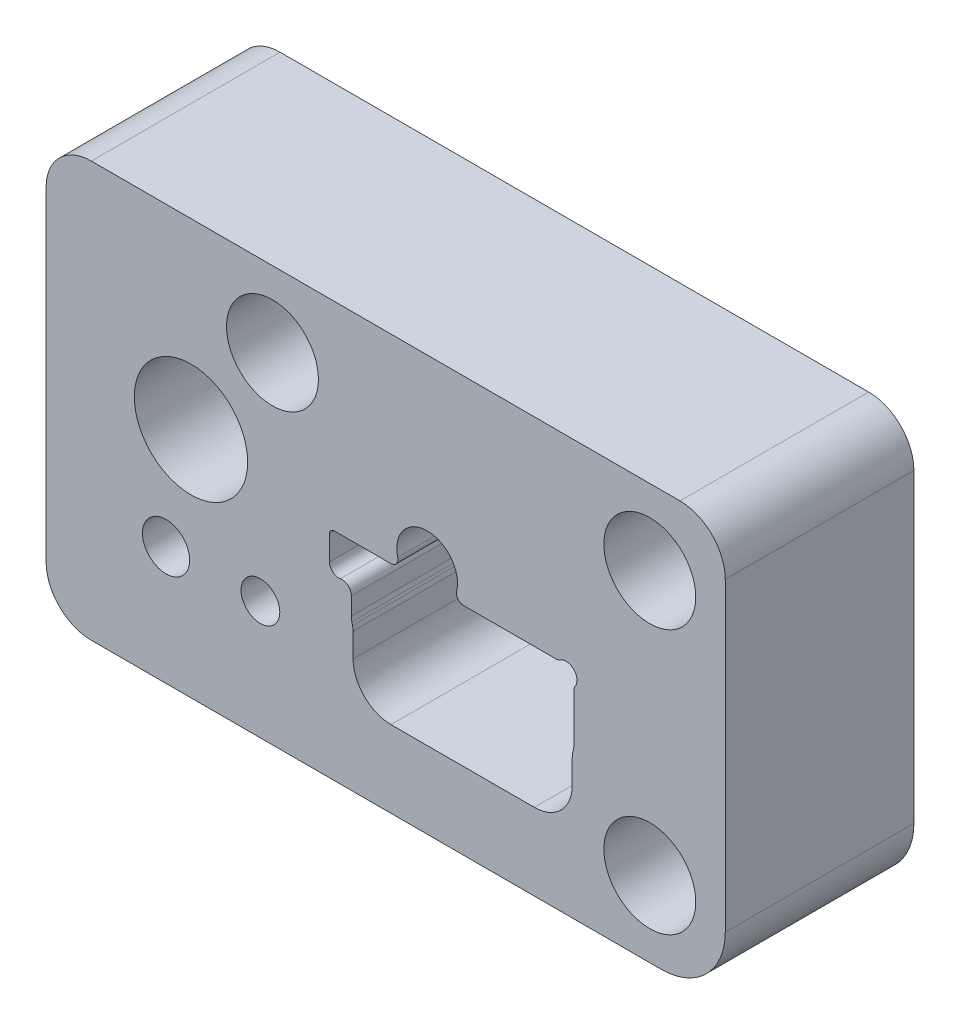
ISO-10303-21;
HEADER;
FILE_DESCRIPTION(('STEP AP214'),'2;1');
FILE_NAME('part.step','',(''),(''),'','','');
FILE_SCHEMA(('AUTOMOTIVE_DESIGN { 1 0 10303 214 1 1 1 1 }'));
ENDSEC;
DATA;
#1=APPLICATION_CONTEXT('core data for automotive mechanical design processes');
#2=APPLICATION_PROTOCOL_DEFINITION('international standard','automotive_design',2000,#1);
#3=PRODUCT_CONTEXT('',#1,'mechanical');
#4=PRODUCT('Part','Part','',(#3));
#5=PRODUCT_RELATED_PRODUCT_CATEGORY('part','',(#4));
#6=PRODUCT_DEFINITION_FORMATION('','',#4);
#7=PRODUCT_DEFINITION_CONTEXT('part definition',#1,'design');
#8=PRODUCT_DEFINITION('design','',#6,#7);
#9=PRODUCT_DEFINITION_SHAPE('','',#8);
#10=(LENGTH_UNIT() NAMED_UNIT(*) SI_UNIT(.MILLI.,.METRE.));
#11=(NAMED_UNIT(*) PLANE_ANGLE_UNIT() SI_UNIT($,.RADIAN.));
#12=(NAMED_UNIT(*) SI_UNIT($,.STERADIAN.) SOLID_ANGLE_UNIT());
#13=UNCERTAINTY_MEASURE_WITH_UNIT(LENGTH_MEASURE(1.E-05),#10,'distance_accuracy_value','');
#14=(GEOMETRIC_REPRESENTATION_CONTEXT(3) GLOBAL_UNCERTAINTY_ASSIGNED_CONTEXT((#13)) GLOBAL_UNIT_ASSIGNED_CONTEXT((#10,
#11,#12)) REPRESENTATION_CONTEXT('',''));
#15=CARTESIAN_POINT('',(0.,0.,0.));
#16=DIRECTION('',(0.,0.,1.));
#17=DIRECTION('',(1.,0.,0.));
#18=AXIS2_PLACEMENT_3D('',#15,#16,#17);
#19=CARTESIAN_POINT('',(-156.27604,-88.8003363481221,-31.75));
#20=DIRECTION('',(-1.,0.,0.));
#21=DIRECTION('',(0.,-1.,0.));
#22=AXIS2_PLACEMENT_3D('',#19,#20,#21);
#23=PLANE('',#22);
#24=DIRECTION('',(0.,0.,1.));
#25=VECTOR('',#24,1.);
#26=CARTESIAN_POINT('',(-156.27604,-89.1130965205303,-31.75));
#27=LINE('',#26,#25);
#28=CARTESIAN_POINT('',(-156.27604,-89.1130965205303,-31.75));
#29=VERTEX_POINT('',#28);
#30=CARTESIAN_POINT('',(-156.27604,-89.1130965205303,0.));
#31=VERTEX_POINT('',#30);
#32=EDGE_CURVE('E607',#29,#31,#27,.T.);
#33=ORIENTED_EDGE('',*,*,#32,.T.);
#34=DIRECTION('',(0.,-1.,0.));
#35=VECTOR('',#34,1.);
#36=CARTESIAN_POINT('',(-156.27604,-88.8003363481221,0.));
#37=LINE('',#36,#35);
#38=CARTESIAN_POINT('',(-156.27604,-92.0343710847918,0.));
#39=VERTEX_POINT('',#38);
#40=EDGE_CURVE('E561',#31,#39,#37,.T.);
#41=ORIENTED_EDGE('',*,*,#40,.T.);
#42=DIRECTION('',(0.,0.,1.));
#43=VECTOR('',#42,1.);
#44=CARTESIAN_POINT('',(-156.27604,-92.0343710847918,-31.75));
#45=LINE('',#44,#43);
#46=CARTESIAN_POINT('',(-156.27604,-92.0343710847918,-31.75));
#47=VERTEX_POINT('',#46);
#48=EDGE_CURVE('E291',#47,#39,#45,.T.);
#49=ORIENTED_EDGE('',*,*,#48,.F.);
#50=DIRECTION('',(0.,-1.,0.));
#51=VECTOR('',#50,1.);
#52=CARTESIAN_POINT('',(-156.27604,-88.8003363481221,-31.75));
#53=LINE('',#52,#51);
#54=EDGE_CURVE('E72',#29,#47,#53,.T.);
#55=ORIENTED_EDGE('',*,*,#54,.F.);
#56=EDGE_LOOP('',(#33,#41,#49,#55));
#57=FACE_BOUND('',#56,.T.);
#58=ADVANCED_FACE('F47',(#57),#23,.F.);
#59=CARTESIAN_POINT('',(-100.965,-55.245,-31.75));
#60=DIRECTION('',(0.,0.,1.));
#61=DIRECTION('',(1.,0.,0.));
#62=AXIS2_PLACEMENT_3D('',#59,#60,#61);
#63=CYLINDRICAL_SURFACE('',#62,7.62000000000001);
#64=CARTESIAN_POINT('',(-100.965,-55.245,0.));
#65=DIRECTION('',(0.,0.,1.));
#66=DIRECTION('',(-1.,0.,0.));
#67=AXIS2_PLACEMENT_3D('',#64,#65,#66);
#68=CIRCLE('',#67,7.62000000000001);
#69=CARTESIAN_POINT('',(-93.345,-55.245,0.));
#70=VERTEX_POINT('',#69);
#71=CARTESIAN_POINT('',(-100.965,-47.625,0.));
#72=VERTEX_POINT('',#71);
#73=EDGE_CURVE('E393',#70,#72,#68,.T.);
#74=ORIENTED_EDGE('',*,*,#73,.F.);
#75=DIRECTION('',(0.,0.,1.));
#76=VECTOR('',#75,1.);
#77=CARTESIAN_POINT('',(-93.345,-55.245,-31.75));
#78=LINE('',#77,#76);
#79=CARTESIAN_POINT('',(-93.345,-55.245,-31.75));
#80=VERTEX_POINT('',#79);
#81=EDGE_CURVE('E11',#80,#70,#78,.T.);
#82=ORIENTED_EDGE('',*,*,#81,.F.);
#83=CARTESIAN_POINT('',(-100.965,-55.245,-31.75));
#84=DIRECTION('',(0.,0.,1.));
#85=DIRECTION('',(-1.,0.,0.));
#86=AXIS2_PLACEMENT_3D('',#83,#84,#85);
#87=CIRCLE('',#86,7.62000000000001);
#88=CARTESIAN_POINT('',(-100.965,-47.625,-31.75));
#89=VERTEX_POINT('',#88);
#90=EDGE_CURVE('E394',#80,#89,#87,.T.);
#91=ORIENTED_EDGE('',*,*,#90,.T.);
#92=DIRECTION('',(0.,0.,1.));
#93=VECTOR('',#92,1.);
#94=CARTESIAN_POINT('',(-100.965,-47.625,-31.75));
#95=LINE('',#94,#93);
#96=EDGE_CURVE('E51',#89,#72,#95,.T.);
#97=ORIENTED_EDGE('',*,*,#96,.T.);
#98=EDGE_LOOP('',(#74,#82,#91,#97));
#99=FACE_BOUND('',#98,.T.);
#100=ADVANCED_FACE('F49',(#99),#63,.T.);
#101=CARTESIAN_POINT('',(-93.345,-55.245,-31.75));
#102=DIRECTION('',(1.,0.,0.));
#103=DIRECTION('',(0.,0.,-1.));
#104=AXIS2_PLACEMENT_3D('',#101,#102,#103);
#105=PLANE('',#104);
#106=DIRECTION('',(0.,1.,0.));
#107=VECTOR('',#106,1.);
#108=CARTESIAN_POINT('',(-93.345,-55.245,0.));
#109=LINE('',#108,#107);
#110=CARTESIAN_POINT('',(-93.345,-106.68,0.));
#111=VERTEX_POINT('',#110);
#112=EDGE_CURVE('E398',#111,#70,#109,.T.);
#113=ORIENTED_EDGE('',*,*,#112,.F.);
#114=DIRECTION('',(0.,0.,1.));
#115=VECTOR('',#114,1.);
#116=CARTESIAN_POINT('',(-93.345,-106.68,-31.75));
#117=LINE('',#116,#115);
#118=CARTESIAN_POINT('',(-93.345,-106.68,-31.75));
#119=VERTEX_POINT('',#118);
#120=EDGE_CURVE('E56',#119,#111,#117,.T.);
#121=ORIENTED_EDGE('',*,*,#120,.F.);
#122=DIRECTION('',(0.,1.,0.));
#123=VECTOR('',#122,1.);
#124=CARTESIAN_POINT('',(-93.345,-55.245,-31.75));
#125=LINE('',#124,#123);
#126=EDGE_CURVE('E416',#119,#80,#125,.T.);
#127=ORIENTED_EDGE('',*,*,#126,.T.);
#128=ORIENTED_EDGE('',*,*,#81,.T.);
#129=EDGE_LOOP('',(#113,#121,#127,#128));
#130=FACE_BOUND('',#129,.T.);
#131=ADVANCED_FACE('F463',(#130),#105,.T.);
#132=CARTESIAN_POINT('',(-104.14,-106.68,-31.75));
#133=DIRECTION('',(0.,0.,1.));
#134=DIRECTION('',(1.,0.,0.));
#135=AXIS2_PLACEMENT_3D('',#132,#133,#134);
#136=CYLINDRICAL_SURFACE('',#135,10.795);
#137=CARTESIAN_POINT('',(-104.14,-106.68,0.));
#138=DIRECTION('',(0.,0.,1.));
#139=DIRECTION('',(1.,0.,0.));
#140=AXIS2_PLACEMENT_3D('',#137,#138,#139);
#141=CIRCLE('',#140,10.795);
#142=CARTESIAN_POINT('',(-104.14,-117.475,0.));
#143=VERTEX_POINT('',#142);
#144=EDGE_CURVE('E436',#143,#111,#141,.T.);
#145=ORIENTED_EDGE('',*,*,#144,.F.);
#146=DIRECTION('',(0.,0.,1.));
#147=VECTOR('',#146,1.);
#148=CARTESIAN_POINT('',(-104.14,-117.475,-31.75));
#149=LINE('',#148,#147);
#150=CARTESIAN_POINT('',(-104.14,-117.475,-31.75));
#151=VERTEX_POINT('',#150);
#152=EDGE_CURVE('E442',#151,#143,#149,.T.);
#153=ORIENTED_EDGE('',*,*,#152,.F.);
#154=CARTESIAN_POINT('',(-104.14,-106.68,-31.75));
#155=DIRECTION('',(0.,0.,1.));
#156=DIRECTION('',(1.,0.,0.));
#157=AXIS2_PLACEMENT_3D('',#154,#155,#156);
#158=CIRCLE('',#157,10.795);
#159=EDGE_CURVE('E413',#151,#119,#158,.T.);
#160=ORIENTED_EDGE('',*,*,#159,.T.);
#161=ORIENTED_EDGE('',*,*,#120,.T.);
#162=EDGE_LOOP('',(#145,#153,#160,#161));
#163=FACE_BOUND('',#162,.T.);
#164=ADVANCED_FACE('F483',(#163),#136,.T.);
#165=CARTESIAN_POINT('',(-200.025,-117.475,-31.75));
#166=DIRECTION('',(0.,-1.,0.));
#167=DIRECTION('',(1.,0.,0.));
#168=AXIS2_PLACEMENT_3D('',#165,#166,#167);
#169=PLANE('',#168);
#170=DIRECTION('',(1.,0.,0.));
#171=VECTOR('',#170,1.);
#172=CARTESIAN_POINT('',(-200.025,-117.475,0.));
#173=LINE('',#172,#171);
#174=CARTESIAN_POINT('',(-200.025,-117.475,0.));
#175=VERTEX_POINT('',#174);
#176=EDGE_CURVE('E433',#175,#143,#173,.T.);
#177=ORIENTED_EDGE('',*,*,#176,.F.);
#178=DIRECTION('',(0.,0.,1.));
#179=VECTOR('',#178,1.);
#180=CARTESIAN_POINT('',(-200.025,-117.475,-31.75));
#181=LINE('',#180,#179);
#182=CARTESIAN_POINT('',(-200.025,-117.475,-31.75));
#183=VERTEX_POINT('',#182);
#184=EDGE_CURVE('E444',#183,#175,#181,.T.);
#185=ORIENTED_EDGE('',*,*,#184,.F.);
#186=DIRECTION('',(1.,0.,0.));
#187=VECTOR('',#186,1.);
#188=CARTESIAN_POINT('',(-200.025,-117.475,-31.75));
#189=LINE('',#188,#187);
#190=EDGE_CURVE('E410',#183,#151,#189,.T.);
#191=ORIENTED_EDGE('',*,*,#190,.T.);
#192=ORIENTED_EDGE('',*,*,#152,.T.);
#193=EDGE_LOOP('',(#177,#185,#191,#192));
#194=FACE_BOUND('',#193,.T.);
#195=ADVANCED_FACE('F481',(#194),#169,.T.);
#196=CARTESIAN_POINT('',(-200.025,-109.855,-31.75));
#197=DIRECTION('',(0.,0.,1.));
#198=DIRECTION('',(1.,0.,0.));
#199=AXIS2_PLACEMENT_3D('',#196,#197,#198);
#200=CYLINDRICAL_SURFACE('',#199,7.61999999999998);
#201=CARTESIAN_POINT('',(-200.025,-109.855,0.));
#202=DIRECTION('',(0.,0.,1.));
#203=DIRECTION('',(1.,0.,0.));
#204=AXIS2_PLACEMENT_3D('',#201,#202,#203);
#205=CIRCLE('',#204,7.61999999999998);
#206=CARTESIAN_POINT('',(-207.645,-109.855,0.));
#207=VERTEX_POINT('',#206);
#208=EDGE_CURVE('E430',#207,#175,#205,.T.);
#209=ORIENTED_EDGE('',*,*,#208,.F.);
#210=DIRECTION('',(0.,0.,1.));
#211=VECTOR('',#210,1.);
#212=CARTESIAN_POINT('',(-207.645,-109.855,-31.75));
#213=LINE('',#212,#211);
#214=CARTESIAN_POINT('',(-207.645,-109.855,-31.75));
#215=VERTEX_POINT('',#214);
#216=EDGE_CURVE('E446',#215,#207,#213,.T.);
#217=ORIENTED_EDGE('',*,*,#216,.F.);
#218=CARTESIAN_POINT('',(-200.025,-109.855,-31.75));
#219=DIRECTION('',(0.,0.,1.));
#220=DIRECTION('',(1.,0.,0.));
#221=AXIS2_PLACEMENT_3D('',#218,#219,#220);
#222=CIRCLE('',#221,7.61999999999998);
#223=EDGE_CURVE('E407',#215,#183,#222,.T.);
#224=ORIENTED_EDGE('',*,*,#223,.T.);
#225=ORIENTED_EDGE('',*,*,#184,.T.);
#226=EDGE_LOOP('',(#209,#217,#224,#225));
#227=FACE_BOUND('',#226,.T.);
#228=ADVANCED_FACE('F477',(#227),#200,.T.);
#229=CARTESIAN_POINT('',(-207.645,-55.245,-31.75));
#230=DIRECTION('',(-1.,0.,0.));
#231=DIRECTION('',(0.,-1.,0.));
#232=AXIS2_PLACEMENT_3D('',#229,#230,#231);
#233=PLANE('',#232);
#234=DIRECTION('',(0.,-1.,0.));
#235=VECTOR('',#234,1.);
#236=CARTESIAN_POINT('',(-207.645,-55.245,0.));
#237=LINE('',#236,#235);
#238=CARTESIAN_POINT('',(-207.645,-55.245,0.));
#239=VERTEX_POINT('',#238);
#240=EDGE_CURVE('E427',#239,#207,#237,.T.);
#241=ORIENTED_EDGE('',*,*,#240,.F.);
#242=DIRECTION('',(0.,0.,1.));
#243=VECTOR('',#242,1.);
#244=CARTESIAN_POINT('',(-207.645,-55.245,-31.75));
#245=LINE('',#244,#243);
#246=CARTESIAN_POINT('',(-207.645,-55.245,-31.75));
#247=VERTEX_POINT('',#246);
#248=EDGE_CURVE('E448',#247,#239,#245,.T.);
#249=ORIENTED_EDGE('',*,*,#248,.F.);
#250=DIRECTION('',(0.,-1.,0.));
#251=VECTOR('',#250,1.);
#252=CARTESIAN_POINT('',(-207.645,-55.245,-31.75));
#253=LINE('',#252,#251);
#254=EDGE_CURVE('E404',#247,#215,#253,.T.);
#255=ORIENTED_EDGE('',*,*,#254,.T.);
#256=ORIENTED_EDGE('',*,*,#216,.T.);
#257=EDGE_LOOP('',(#241,#249,#255,#256));
#258=FACE_BOUND('',#257,.T.);
#259=ADVANCED_FACE('F475',(#258),#233,.T.);
#260=CARTESIAN_POINT('',(-200.025,-55.245,-31.75));
#261=DIRECTION('',(0.,0.,1.));
#262=DIRECTION('',(1.,0.,0.));
#263=AXIS2_PLACEMENT_3D('',#260,#261,#262);
#264=CYLINDRICAL_SURFACE('',#263,7.62);
#265=CARTESIAN_POINT('',(-200.025,-55.245,0.));
#266=DIRECTION('',(0.,0.,1.));
#267=DIRECTION('',(1.,0.,0.));
#268=AXIS2_PLACEMENT_3D('',#265,#266,#267);
#269=CIRCLE('',#268,7.62);
#270=CARTESIAN_POINT('',(-200.025,-47.625,0.));
#271=VERTEX_POINT('',#270);
#272=EDGE_CURVE('E424',#271,#239,#269,.T.);
#273=ORIENTED_EDGE('',*,*,#272,.F.);
#274=DIRECTION('',(0.,0.,1.));
#275=VECTOR('',#274,1.);
#276=CARTESIAN_POINT('',(-200.025,-47.625,-31.75));
#277=LINE('',#276,#275);
#278=CARTESIAN_POINT('',(-200.025,-47.625,-31.75));
#279=VERTEX_POINT('',#278);
#280=EDGE_CURVE('E449',#279,#271,#277,.T.);
#281=ORIENTED_EDGE('',*,*,#280,.F.);
#282=CARTESIAN_POINT('',(-200.025,-55.245,-31.75));
#283=DIRECTION('',(0.,0.,1.));
#284=DIRECTION('',(1.,0.,0.));
#285=AXIS2_PLACEMENT_3D('',#282,#283,#284);
#286=CIRCLE('',#285,7.62);
#287=EDGE_CURVE('E401',#279,#247,#286,.T.);
#288=ORIENTED_EDGE('',*,*,#287,.T.);
#289=ORIENTED_EDGE('',*,*,#248,.T.);
#290=EDGE_LOOP('',(#273,#281,#288,#289));
#291=FACE_BOUND('',#290,.T.);
#292=ADVANCED_FACE('F471',(#291),#264,.T.);
#293=CARTESIAN_POINT('',(-200.025,-47.625,-31.75));
#294=DIRECTION('',(0.,1.,0.));
#295=DIRECTION('',(0.,0.,1.));
#296=AXIS2_PLACEMENT_3D('',#293,#294,#295);
#297=PLANE('',#296);
#298=DIRECTION('',(-1.,0.,0.));
#299=VECTOR('',#298,1.);
#300=CARTESIAN_POINT('',(-200.025,-47.625,0.));
#301=LINE('',#300,#299);
#302=EDGE_CURVE('E421',#72,#271,#301,.T.);
#303=ORIENTED_EDGE('',*,*,#302,.F.);
#304=ORIENTED_EDGE('',*,*,#96,.F.);
#305=DIRECTION('',(-1.,0.,0.));
#306=VECTOR('',#305,1.);
#307=CARTESIAN_POINT('',(-200.025,-47.625,-31.75));
#308=LINE('',#307,#306);
#309=EDGE_CURVE('E397',#89,#279,#308,.T.);
#310=ORIENTED_EDGE('',*,*,#309,.T.);
#311=ORIENTED_EDGE('',*,*,#280,.T.);
#312=EDGE_LOOP('',(#303,#304,#310,#311));
#313=FACE_BOUND('',#312,.T.);
#314=ADVANCED_FACE('F457',(#313),#297,.T.);
#315=CARTESIAN_POINT('',(-100.965,-55.245,-31.75));
#316=DIRECTION('',(0.,0.,-1.));
#317=DIRECTION('',(-1.,0.,0.));
#318=AXIS2_PLACEMENT_3D('',#315,#316,#317);
#319=PLANE('',#318);
#320=CARTESIAN_POINT('',(-157.86354,-89.1130965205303,-31.75));
#321=DIRECTION('',(0.,0.,-1.));
#322=DIRECTION('',(1.,0.,0.));
#323=AXIS2_PLACEMENT_3D('',#320,#321,#322);
#324=CIRCLE('',#323,1.58750000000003);
#325=CARTESIAN_POINT('',(-158.11754,-87.5460482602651,-31.75));
#326=VERTEX_POINT('',#325);
#327=EDGE_CURVE('E284',#326,#29,#324,.T.);
#328=ORIENTED_EDGE('',*,*,#327,.T.);
#329=ORIENTED_EDGE('',*,*,#54,.T.);
#330=CARTESIAN_POINT('',(-152.59304,-92.0343710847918,-31.75));
#331=DIRECTION('',(0.,0.,1.));
#332=DIRECTION('',(1.,0.,0.));
#333=AXIS2_PLACEMENT_3D('',#330,#331,#332);
#334=CIRCLE('',#333,3.68299999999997);
#335=CARTESIAN_POINT('',(-156.180752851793,-92.8667204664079,-31.75));
#336=VERTEX_POINT('',#335);
#337=EDGE_CURVE('E673',#47,#336,#334,.T.);
#338=ORIENTED_EDGE('',*,*,#337,.T.);
#339=DIRECTION('',(0.22599765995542,-0.974127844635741,0.));
#340=VECTOR('',#339,1.);
#341=CARTESIAN_POINT('',(-156.180752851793,-92.8667204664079,-31.75));
#342=LINE('',#341,#340);
#343=CARTESIAN_POINT('',(-156.076687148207,-93.3152795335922,-31.75));
#344=VERTEX_POINT('',#343);
#345=EDGE_CURVE('E675',#336,#344,#342,.T.);
#346=ORIENTED_EDGE('',*,*,#345,.T.);
#347=CARTESIAN_POINT('',(-159.6644,-94.1476289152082,-31.75));
#348=DIRECTION('',(0.,0.,-1.));
#349=DIRECTION('',(1.,0.,0.));
#350=AXIS2_PLACEMENT_3D('',#347,#348,#349);
#351=CIRCLE('',#350,3.68299999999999);
#352=CARTESIAN_POINT('',(-155.9814,-94.1476289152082,-31.75));
#353=VERTEX_POINT('',#352);
#354=EDGE_CURVE('E678',#344,#353,#351,.T.);
#355=ORIENTED_EDGE('',*,*,#354,.T.);
#356=DIRECTION('',(0.,-1.,0.));
#357=VECTOR('',#356,1.);
#358=CARTESIAN_POINT('',(-155.9814,-94.1476289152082,-31.75));
#359=LINE('',#358,#357);
#360=CARTESIAN_POINT('',(-155.9814,-98.171,-31.75));
#361=VERTEX_POINT('',#360);
#362=EDGE_CURVE('E681',#353,#361,#359,.T.);
#363=ORIENTED_EDGE('',*,*,#362,.T.);
#364=CARTESIAN_POINT('',(-149.606,-98.171,-31.75));
#365=DIRECTION('',(0.,0.,1.));
#366=DIRECTION('',(1.,0.,0.));
#367=AXIS2_PLACEMENT_3D('',#364,#365,#366);
#368=CIRCLE('',#367,6.37539999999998);
#369=CARTESIAN_POINT('',(-149.606,-104.5464,-31.75));
#370=VERTEX_POINT('',#369);
#371=EDGE_CURVE('E684',#361,#370,#368,.T.);
#372=ORIENTED_EDGE('',*,*,#371,.T.);
#373=DIRECTION('',(1.,0.,0.));
#374=VECTOR('',#373,1.);
#375=CARTESIAN_POINT('',(-149.606,-104.5464,-31.75));
#376=LINE('',#375,#374);
#377=CARTESIAN_POINT('',(-125.476,-104.5464,-31.75));
#378=VERTEX_POINT('',#377);
#379=EDGE_CURVE('E687',#370,#378,#376,.T.);
#380=ORIENTED_EDGE('',*,*,#379,.T.);
#381=CARTESIAN_POINT('',(-125.476,-98.171,-31.75));
#382=DIRECTION('',(0.,0.,1.));
#383=DIRECTION('',(1.,0.,0.));
#384=AXIS2_PLACEMENT_3D('',#381,#382,#383);
#385=CIRCLE('',#384,6.37539999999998);
#386=CARTESIAN_POINT('',(-119.1006,-98.171,-31.75));
#387=VERTEX_POINT('',#386);
#388=EDGE_CURVE('E690',#378,#387,#385,.T.);
#389=ORIENTED_EDGE('',*,*,#388,.T.);
#390=DIRECTION('',(0.,1.,0.));
#391=VECTOR('',#390,1.);
#392=CARTESIAN_POINT('',(-119.1006,-98.171,-31.75));
#393=LINE('',#392,#391);
#394=CARTESIAN_POINT('',(-119.1006,-94.1476289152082,-31.75));
#395=VERTEX_POINT('',#394);
#396=EDGE_CURVE('E693',#387,#395,#393,.T.);
#397=ORIENTED_EDGE('',*,*,#396,.T.);
#398=CARTESIAN_POINT('',(-115.4176,-94.1476289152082,-31.75));
#399=DIRECTION('',(0.,0.,-1.));
#400=DIRECTION('',(-1.,0.,0.));
#401=AXIS2_PLACEMENT_3D('',#398,#399,#400);
#402=CIRCLE('',#401,3.683);
#403=CARTESIAN_POINT('',(-119.005312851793,-93.3152795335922,-31.75));
#404=VERTEX_POINT('',#403);
#405=EDGE_CURVE('E696',#395,#404,#402,.T.);
#406=ORIENTED_EDGE('',*,*,#405,.T.);
#407=DIRECTION('',(0.225997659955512,0.97412784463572,0.));
#408=VECTOR('',#407,1.);
#409=CARTESIAN_POINT('',(-119.005312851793,-93.3152795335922,-31.75));
#410=LINE('',#409,#408);
#411=CARTESIAN_POINT('',(-118.901247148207,-92.8667204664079,-31.75));
#412=VERTEX_POINT('',#411);
#413=EDGE_CURVE('E699',#404,#412,#410,.T.);
#414=ORIENTED_EDGE('',*,*,#413,.T.);
#415=CARTESIAN_POINT('',(-122.48896,-92.0343710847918,-31.75));
#416=DIRECTION('',(0.,0.,1.));
#417=DIRECTION('',(-1.,0.,0.));
#418=AXIS2_PLACEMENT_3D('',#415,#416,#417);
#419=CIRCLE('',#418,3.68300000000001);
#420=CARTESIAN_POINT('',(-118.80596,-92.0343710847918,-31.75));
#421=VERTEX_POINT('',#420);
#422=EDGE_CURVE('E702',#412,#421,#419,.T.);
#423=ORIENTED_EDGE('',*,*,#422,.T.);
#424=DIRECTION('',(0.,1.,0.));
#425=VECTOR('',#424,1.);
#426=CARTESIAN_POINT('',(-118.80596,-92.0343710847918,-31.75));
#427=LINE('',#426,#425);
#428=CARTESIAN_POINT('',(-118.80596,-84.1078453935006,-31.75));
#429=VERTEX_POINT('',#428);
#430=EDGE_CURVE('E705',#421,#429,#427,.T.);
#431=ORIENTED_EDGE('',*,*,#430,.T.);
#432=CARTESIAN_POINT('',(-117.602,-84.1078453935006,-31.75));
#433=DIRECTION('',(0.,0.,-1.));
#434=DIRECTION('',(1.,0.,0.));
#435=AXIS2_PLACEMENT_3D('',#432,#433,#434);
#436=CIRCLE('',#435,1.20396);
#437=CARTESIAN_POINT('',(-118.6053,-83.4423314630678,-31.75));
#438=VERTEX_POINT('',#437);
#439=EDGE_CURVE('E708',#429,#438,#436,.T.);
#440=ORIENTED_EDGE('',*,*,#439,.T.);
#441=CARTESIAN_POINT('',(-120.142,-82.423,-31.75));
#442=DIRECTION('',(0.,0.,1.));
#443=DIRECTION('',(1.,0.,0.));
#444=AXIS2_PLACEMENT_3D('',#441,#442,#443);
#445=CIRCLE('',#444,1.84404);
#446=CARTESIAN_POINT('',(-121.161331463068,-80.8863,-31.75));
#447=VERTEX_POINT('',#446);
#448=EDGE_CURVE('E711',#438,#447,#445,.T.);
#449=ORIENTED_EDGE('',*,*,#448,.T.);
#450=CARTESIAN_POINT('',(-121.826845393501,-79.883,-31.75));
#451=DIRECTION('',(0.,0.,-1.));
#452=DIRECTION('',(1.,0.,0.));
#453=AXIS2_PLACEMENT_3D('',#450,#451,#452);
#454=CIRCLE('',#453,1.20396);
#455=CARTESIAN_POINT('',(-121.826845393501,-81.08696,-31.75));
#456=VERTEX_POINT('',#455);
#457=EDGE_CURVE('E714',#447,#456,#454,.T.);
#458=ORIENTED_EDGE('',*,*,#457,.T.);
#459=DIRECTION('',(-1.,0.,0.));
#460=VECTOR('',#459,1.);
#461=CARTESIAN_POINT('',(-121.826845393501,-81.08696,-31.75));
#462=LINE('',#461,#460);
#463=CARTESIAN_POINT('',(-137.38484648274,-81.08696,-31.75));
#464=VERTEX_POINT('',#463);
#465=EDGE_CURVE('E717',#456,#464,#462,.T.);
#466=ORIENTED_EDGE('',*,*,#465,.T.);
#467=CARTESIAN_POINT('',(-137.38484648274,-79.883,-31.75));
#468=DIRECTION('',(0.,0.,-1.));
#469=DIRECTION('',(1.,0.,0.));
#470=AXIS2_PLACEMENT_3D('',#467,#468,#469);
#471=CIRCLE('',#470,1.20396000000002);
#472=CARTESIAN_POINT('',(-138.553185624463,-79.5923054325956,-31.75));
#473=VERTEX_POINT('',#472);
#474=EDGE_CURVE('E720',#464,#473,#471,.T.);
#475=ORIENTED_EDGE('',*,*,#474,.T.);
#476=CARTESIAN_POINT('',(-143.51,-78.359,-31.75));
#477=DIRECTION('',(0.,0.,1.));
#478=DIRECTION('',(1.,0.,0.));
#479=AXIS2_PLACEMENT_3D('',#476,#477,#478);
#480=CIRCLE('',#479,5.10793999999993);
#481=CARTESIAN_POINT('',(-148.466814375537,-79.5923054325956,-31.75));
#482=VERTEX_POINT('',#481);
#483=EDGE_CURVE('E723',#473,#482,#480,.T.);
#484=ORIENTED_EDGE('',*,*,#483,.T.);
#485=CARTESIAN_POINT('',(-149.63515351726,-79.883,-31.75));
#486=DIRECTION('',(0.,0.,-1.));
#487=DIRECTION('',(1.,0.,0.));
#488=AXIS2_PLACEMENT_3D('',#485,#486,#487);
#489=CIRCLE('',#488,1.20396);
#490=CARTESIAN_POINT('',(-149.63515351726,-81.08696,-31.75));
#491=VERTEX_POINT('',#490);
#492=EDGE_CURVE('E296',#482,#491,#489,.T.);
#493=ORIENTED_EDGE('',*,*,#492,.T.);
#494=DIRECTION('',(-1.,0.,0.));
#495=VECTOR('',#494,1.);
#496=CARTESIAN_POINT('',(-149.63515351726,-81.08696,-31.75));
#497=LINE('',#496,#495);
#498=CARTESIAN_POINT('',(-159.131,-81.08696,-31.75));
#499=VERTEX_POINT('',#498);
#500=EDGE_CURVE('E290',#491,#499,#497,.T.);
#501=ORIENTED_EDGE('',*,*,#500,.T.);
#502=CARTESIAN_POINT('',(-159.131,-81.915,-31.75));
#503=DIRECTION('',(0.,0.,1.));
#504=DIRECTION('',(1.,0.,0.));
#505=AXIS2_PLACEMENT_3D('',#502,#503,#504);
#506=CIRCLE('',#505,0.828039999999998);
#507=CARTESIAN_POINT('',(-159.95904,-81.915,-31.75));
#508=VERTEX_POINT('',#507);
#509=EDGE_CURVE('E280',#499,#508,#506,.T.);
#510=ORIENTED_EDGE('',*,*,#509,.T.);
#511=DIRECTION('',(0.,-1.,0.));
#512=VECTOR('',#511,1.);
#513=CARTESIAN_POINT('',(-159.95904,-81.915,-31.75));
#514=LINE('',#513,#512);
#515=CARTESIAN_POINT('',(-159.95904,-85.979,-31.75));
#516=VERTEX_POINT('',#515);
#517=EDGE_CURVE('E264',#508,#516,#514,.T.);
#518=ORIENTED_EDGE('',*,*,#517,.T.);
#519=CARTESIAN_POINT('',(-158.37154,-85.979,-31.75));
#520=DIRECTION('',(0.,0.,1.));
#521=DIRECTION('',(1.,0.,0.));
#522=AXIS2_PLACEMENT_3D('',#519,#520,#521);
#523=CIRCLE('',#522,1.58749999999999);
#524=EDGE_CURVE('E274',#516,#326,#523,.T.);
#525=ORIENTED_EDGE('',*,*,#524,.T.);
#526=EDGE_LOOP('',(#328,#329,#338,#346,#355,#363,#372,#380,#389,#397,#406,#414,#423,#431,#440,
#449,#458,#466,#475,#484,#493,#501,#510,#518,#525));
#527=FACE_BOUND('',#526,.T.);
#528=CARTESIAN_POINT('',(-187.452,-97.536,-31.75));
#529=DIRECTION('',(0.,0.,-1.));
#530=DIRECTION('',(-1.,0.,0.));
#531=AXIS2_PLACEMENT_3D('',#528,#529,#530);
#532=CIRCLE('',#531,3.96874999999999);
#533=CARTESIAN_POINT('',(-191.42075,-97.536,-31.75));
#534=VERTEX_POINT('',#533);
#535=EDGE_CURVE('E342',#534,#534,#532,.T.);
#536=ORIENTED_EDGE('',*,*,#535,.F.);
#537=EDGE_LOOP('',(#536));
#538=FACE_BOUND('',#537,.T.);
#539=CARTESIAN_POINT('',(-171.577,-97.536,-31.75));
#540=DIRECTION('',(0.,0.,1.));
#541=DIRECTION('',(1.,0.,0.));
#542=AXIS2_PLACEMENT_3D('',#539,#540,#541);
#543=CIRCLE('',#542,3.26389999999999);
#544=CARTESIAN_POINT('',(-168.3131,-97.536,-31.75));
#545=VERTEX_POINT('',#544);
#546=EDGE_CURVE('E345',#545,#545,#543,.T.);
#547=ORIENTED_EDGE('',*,*,#546,.T.);
#548=EDGE_LOOP('',(#547));
#549=FACE_BOUND('',#548,.T.);
#550=CARTESIAN_POINT('',(-183.261,-78.359,-31.75));
#551=DIRECTION('',(0.,0.,1.));
#552=DIRECTION('',(1.,0.,0.));
#553=AXIS2_PLACEMENT_3D('',#550,#551,#552);
#554=CIRCLE('',#553,9.53769999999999);
#555=CARTESIAN_POINT('',(-173.7233,-78.359,-31.75));
#556=VERTEX_POINT('',#555);
#557=EDGE_CURVE('E352',#556,#556,#554,.T.);
#558=ORIENTED_EDGE('',*,*,#557,.T.);
#559=EDGE_LOOP('',(#558));
#560=FACE_BOUND('',#559,.T.);
#561=CARTESIAN_POINT('',(-106.045,-60.325,-31.75));
#562=DIRECTION('',(0.,0.,1.));
#563=DIRECTION('',(1.,0.,0.));
#564=AXIS2_PLACEMENT_3D('',#561,#562,#563);
#565=CIRCLE('',#564,5.15619999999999);
#566=CARTESIAN_POINT('',(-100.8888,-60.325,-31.75));
#567=VERTEX_POINT('',#566);
#568=EDGE_CURVE('E355',#567,#567,#565,.T.);
#569=ORIENTED_EDGE('',*,*,#568,.T.);
#570=EDGE_LOOP('',(#569));
#571=FACE_BOUND('',#570,.T.);
#572=CARTESIAN_POINT('',(-106.045,-104.775,-31.75));
#573=DIRECTION('',(0.,0.,1.));
#574=DIRECTION('',(1.,0.,0.));
#575=AXIS2_PLACEMENT_3D('',#572,#573,#574);
#576=CIRCLE('',#575,5.15619999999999);
#577=CARTESIAN_POINT('',(-100.8888,-104.775,-31.75));
#578=VERTEX_POINT('',#577);
#579=EDGE_CURVE('E369',#578,#578,#576,.T.);
#580=ORIENTED_EDGE('',*,*,#579,.T.);
#581=EDGE_LOOP('',(#580));
#582=FACE_BOUND('',#581,.T.);
#583=CARTESIAN_POINT('',(-169.545,-60.325,-31.75));
#584=DIRECTION('',(0.,0.,1.));
#585=DIRECTION('',(1.,0.,0.));
#586=AXIS2_PLACEMENT_3D('',#583,#584,#585);
#587=CIRCLE('',#586,5.1562);
#588=CARTESIAN_POINT('',(-164.3888,-60.325,-31.75));
#589=VERTEX_POINT('',#588);
#590=EDGE_CURVE('E381',#589,#589,#587,.T.);
#591=ORIENTED_EDGE('',*,*,#590,.T.);
#592=EDGE_LOOP('',(#591));
#593=FACE_BOUND('',#592,.T.);
#594=ORIENTED_EDGE('',*,*,#90,.F.);
#595=ORIENTED_EDGE('',*,*,#126,.F.);
#596=ORIENTED_EDGE('',*,*,#159,.F.);
#597=ORIENTED_EDGE('',*,*,#190,.F.);
#598=ORIENTED_EDGE('',*,*,#223,.F.);
#599=ORIENTED_EDGE('',*,*,#254,.F.);
#600=ORIENTED_EDGE('',*,*,#287,.F.);
#601=ORIENTED_EDGE('',*,*,#309,.F.);
#602=EDGE_LOOP('',(#594,#595,#596,#597,#598,#599,#600,#601));
#603=FACE_BOUND('',#602,.T.);
#604=ADVANCED_FACE('F286',(#527,#538,#549,#560,#571,#582,#593,#603),#319,.T.);
#605=CARTESIAN_POINT('',(-100.965,-55.245,0.));
#606=DIRECTION('',(0.,0.,-1.));
#607=DIRECTION('',(-1.,0.,0.));
#608=AXIS2_PLACEMENT_3D('',#605,#606,#607);
#609=PLANE('',#608);
#610=ORIENTED_EDGE('',*,*,#40,.F.);
#611=CARTESIAN_POINT('',(-157.86354,-89.1130965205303,0.));
#612=DIRECTION('',(0.,0.,-1.));
#613=DIRECTION('',(1.,0.,0.));
#614=AXIS2_PLACEMENT_3D('',#611,#612,#613);
#615=CIRCLE('',#614,1.58750000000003);
#616=CARTESIAN_POINT('',(-158.11754,-87.5460482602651,0.));
#617=VERTEX_POINT('',#616);
#618=EDGE_CURVE('E64',#617,#31,#615,.T.);
#619=ORIENTED_EDGE('',*,*,#618,.F.);
#620=CARTESIAN_POINT('',(-158.37154,-85.979,0.));
#621=DIRECTION('',(0.,0.,1.));
#622=DIRECTION('',(1.,0.,0.));
#623=AXIS2_PLACEMENT_3D('',#620,#621,#622);
#624=CIRCLE('',#623,1.58749999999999);
#625=CARTESIAN_POINT('',(-159.95904,-85.979,0.));
#626=VERTEX_POINT('',#625);
#627=EDGE_CURVE('E735',#626,#617,#624,.T.);
#628=ORIENTED_EDGE('',*,*,#627,.F.);
#629=DIRECTION('',(0.,-1.,0.));
#630=VECTOR('',#629,1.);
#631=CARTESIAN_POINT('',(-159.95904,-81.915,0.));
#632=LINE('',#631,#630);
#633=CARTESIAN_POINT('',(-159.95904,-81.915,0.));
#634=VERTEX_POINT('',#633);
#635=EDGE_CURVE('E733',#634,#626,#632,.T.);
#636=ORIENTED_EDGE('',*,*,#635,.F.);
#637=CARTESIAN_POINT('',(-159.131,-81.915,0.));
#638=DIRECTION('',(0.,0.,1.));
#639=DIRECTION('',(1.,0.,0.));
#640=AXIS2_PLACEMENT_3D('',#637,#638,#639);
#641=CIRCLE('',#640,0.828039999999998);
#642=CARTESIAN_POINT('',(-159.131,-81.08696,0.));
#643=VERTEX_POINT('',#642);
#644=EDGE_CURVE('E283',#643,#634,#641,.T.);
#645=ORIENTED_EDGE('',*,*,#644,.F.);
#646=DIRECTION('',(-1.,0.,0.));
#647=VECTOR('',#646,1.);
#648=CARTESIAN_POINT('',(-149.63515351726,-81.08696,0.));
#649=LINE('',#648,#647);
#650=CARTESIAN_POINT('',(-149.63515351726,-81.08696,0.));
#651=VERTEX_POINT('',#650);
#652=EDGE_CURVE('E668',#651,#643,#649,.T.);
#653=ORIENTED_EDGE('',*,*,#652,.F.);
#654=CARTESIAN_POINT('',(-149.63515351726,-79.883,0.));
#655=DIRECTION('',(0.,0.,-1.));
#656=DIRECTION('',(1.,0.,0.));
#657=AXIS2_PLACEMENT_3D('',#654,#655,#656);
#658=CIRCLE('',#657,1.20396);
#659=CARTESIAN_POINT('',(-148.466814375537,-79.5923054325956,0.));
#660=VERTEX_POINT('',#659);
#661=EDGE_CURVE('E665',#660,#651,#658,.T.);
#662=ORIENTED_EDGE('',*,*,#661,.F.);
#663=CARTESIAN_POINT('',(-143.51,-78.359,0.));
#664=DIRECTION('',(0.,0.,1.));
#665=DIRECTION('',(1.,0.,0.));
#666=AXIS2_PLACEMENT_3D('',#663,#664,#665);
#667=CIRCLE('',#666,5.10793999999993);
#668=CARTESIAN_POINT('',(-138.553185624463,-79.5923054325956,0.));
#669=VERTEX_POINT('',#668);
#670=EDGE_CURVE('E662',#669,#660,#667,.T.);
#671=ORIENTED_EDGE('',*,*,#670,.F.);
#672=CARTESIAN_POINT('',(-137.38484648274,-79.883,0.));
#673=DIRECTION('',(0.,0.,-1.));
#674=DIRECTION('',(1.,0.,0.));
#675=AXIS2_PLACEMENT_3D('',#672,#673,#674);
#676=CIRCLE('',#675,1.20396000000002);
#677=CARTESIAN_POINT('',(-137.38484648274,-81.08696,0.));
#678=VERTEX_POINT('',#677);
#679=EDGE_CURVE('E659',#678,#669,#676,.T.);
#680=ORIENTED_EDGE('',*,*,#679,.F.);
#681=DIRECTION('',(-1.,0.,0.));
#682=VECTOR('',#681,1.);
#683=CARTESIAN_POINT('',(-121.826845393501,-81.08696,0.));
#684=LINE('',#683,#682);
#685=CARTESIAN_POINT('',(-121.826845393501,-81.08696,0.));
#686=VERTEX_POINT('',#685);
#687=EDGE_CURVE('E656',#686,#678,#684,.T.);
#688=ORIENTED_EDGE('',*,*,#687,.F.);
#689=CARTESIAN_POINT('',(-121.826845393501,-79.883,0.));
#690=DIRECTION('',(0.,0.,-1.));
#691=DIRECTION('',(1.,0.,0.));
#692=AXIS2_PLACEMENT_3D('',#689,#690,#691);
#693=CIRCLE('',#692,1.20396);
#694=CARTESIAN_POINT('',(-121.161331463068,-80.8863,0.));
#695=VERTEX_POINT('',#694);
#696=EDGE_CURVE('E653',#695,#686,#693,.T.);
#697=ORIENTED_EDGE('',*,*,#696,.F.);
#698=CARTESIAN_POINT('',(-120.142,-82.423,0.));
#699=DIRECTION('',(0.,0.,1.));
#700=DIRECTION('',(1.,0.,0.));
#701=AXIS2_PLACEMENT_3D('',#698,#699,#700);
#702=CIRCLE('',#701,1.84404);
#703=CARTESIAN_POINT('',(-118.6053,-83.4423314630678,0.));
#704=VERTEX_POINT('',#703);
#705=EDGE_CURVE('E650',#704,#695,#702,.T.);
#706=ORIENTED_EDGE('',*,*,#705,.F.);
#707=CARTESIAN_POINT('',(-117.602,-84.1078453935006,0.));
#708=DIRECTION('',(0.,0.,-1.));
#709=DIRECTION('',(1.,0.,0.));
#710=AXIS2_PLACEMENT_3D('',#707,#708,#709);
#711=CIRCLE('',#710,1.20396);
#712=CARTESIAN_POINT('',(-118.80596,-84.1078453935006,0.));
#713=VERTEX_POINT('',#712);
#714=EDGE_CURVE('E647',#713,#704,#711,.T.);
#715=ORIENTED_EDGE('',*,*,#714,.F.);
#716=DIRECTION('',(0.,1.,0.));
#717=VECTOR('',#716,1.);
#718=CARTESIAN_POINT('',(-118.80596,-92.0343710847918,0.));
#719=LINE('',#718,#717);
#720=CARTESIAN_POINT('',(-118.80596,-92.0343710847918,0.));
#721=VERTEX_POINT('',#720);
#722=EDGE_CURVE('E644',#721,#713,#719,.T.);
#723=ORIENTED_EDGE('',*,*,#722,.F.);
#724=CARTESIAN_POINT('',(-122.48896,-92.0343710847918,0.));
#725=DIRECTION('',(0.,0.,1.));
#726=DIRECTION('',(-1.,0.,0.));
#727=AXIS2_PLACEMENT_3D('',#724,#725,#726);
#728=CIRCLE('',#727,3.68300000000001);
#729=CARTESIAN_POINT('',(-118.901247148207,-92.8667204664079,0.));
#730=VERTEX_POINT('',#729);
#731=EDGE_CURVE('E641',#730,#721,#728,.T.);
#732=ORIENTED_EDGE('',*,*,#731,.F.);
#733=DIRECTION('',(0.225997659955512,0.97412784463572,0.));
#734=VECTOR('',#733,1.);
#735=CARTESIAN_POINT('',(-119.005312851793,-93.3152795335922,0.));
#736=LINE('',#735,#734);
#737=CARTESIAN_POINT('',(-119.005312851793,-93.3152795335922,0.));
#738=VERTEX_POINT('',#737);
#739=EDGE_CURVE('E638',#738,#730,#736,.T.);
#740=ORIENTED_EDGE('',*,*,#739,.F.);
#741=CARTESIAN_POINT('',(-115.4176,-94.1476289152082,0.));
#742=DIRECTION('',(0.,0.,-1.));
#743=DIRECTION('',(-1.,0.,0.));
#744=AXIS2_PLACEMENT_3D('',#741,#742,#743);
#745=CIRCLE('',#744,3.683);
#746=CARTESIAN_POINT('',(-119.1006,-94.1476289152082,0.));
#747=VERTEX_POINT('',#746);
#748=EDGE_CURVE('E635',#747,#738,#745,.T.);
#749=ORIENTED_EDGE('',*,*,#748,.F.);
#750=DIRECTION('',(0.,1.,0.));
#751=VECTOR('',#750,1.);
#752=CARTESIAN_POINT('',(-119.1006,-98.171,0.));
#753=LINE('',#752,#751);
#754=CARTESIAN_POINT('',(-119.1006,-98.171,0.));
#755=VERTEX_POINT('',#754);
#756=EDGE_CURVE('E632',#755,#747,#753,.T.);
#757=ORIENTED_EDGE('',*,*,#756,.F.);
#758=CARTESIAN_POINT('',(-125.476,-98.171,0.));
#759=DIRECTION('',(0.,0.,1.));
#760=DIRECTION('',(1.,0.,0.));
#761=AXIS2_PLACEMENT_3D('',#758,#759,#760);
#762=CIRCLE('',#761,6.37539999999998);
#763=CARTESIAN_POINT('',(-125.476,-104.5464,0.));
#764=VERTEX_POINT('',#763);
#765=EDGE_CURVE('E629',#764,#755,#762,.T.);
#766=ORIENTED_EDGE('',*,*,#765,.F.);
#767=DIRECTION('',(1.,0.,0.));
#768=VECTOR('',#767,1.);
#769=CARTESIAN_POINT('',(-149.606,-104.5464,0.));
#770=LINE('',#769,#768);
#771=CARTESIAN_POINT('',(-149.606,-104.5464,0.));
#772=VERTEX_POINT('',#771);
#773=EDGE_CURVE('E626',#772,#764,#770,.T.);
#774=ORIENTED_EDGE('',*,*,#773,.F.);
#775=CARTESIAN_POINT('',(-149.606,-98.171,0.));
#776=DIRECTION('',(0.,0.,1.));
#777=DIRECTION('',(1.,0.,0.));
#778=AXIS2_PLACEMENT_3D('',#775,#776,#777);
#779=CIRCLE('',#778,6.37539999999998);
#780=CARTESIAN_POINT('',(-155.9814,-98.171,0.));
#781=VERTEX_POINT('',#780);
#782=EDGE_CURVE('E623',#781,#772,#779,.T.);
#783=ORIENTED_EDGE('',*,*,#782,.F.);
#784=DIRECTION('',(0.,-1.,0.));
#785=VECTOR('',#784,1.);
#786=CARTESIAN_POINT('',(-155.9814,-94.1476289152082,0.));
#787=LINE('',#786,#785);
#788=CARTESIAN_POINT('',(-155.9814,-94.1476289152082,0.));
#789=VERTEX_POINT('',#788);
#790=EDGE_CURVE('E620',#789,#781,#787,.T.);
#791=ORIENTED_EDGE('',*,*,#790,.F.);
#792=CARTESIAN_POINT('',(-159.6644,-94.1476289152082,0.));
#793=DIRECTION('',(0.,0.,-1.));
#794=DIRECTION('',(1.,0.,0.));
#795=AXIS2_PLACEMENT_3D('',#792,#793,#794);
#796=CIRCLE('',#795,3.68299999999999);
#797=CARTESIAN_POINT('',(-156.076687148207,-93.3152795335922,0.));
#798=VERTEX_POINT('',#797);
#799=EDGE_CURVE('E617',#798,#789,#796,.T.);
#800=ORIENTED_EDGE('',*,*,#799,.F.);
#801=DIRECTION('',(0.22599765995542,-0.974127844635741,0.));
#802=VECTOR('',#801,1.);
#803=CARTESIAN_POINT('',(-156.180752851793,-92.8667204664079,0.));
#804=LINE('',#803,#802);
#805=CARTESIAN_POINT('',(-156.180752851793,-92.8667204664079,0.));
#806=VERTEX_POINT('',#805);
#807=EDGE_CURVE('E609',#806,#798,#804,.T.);
#808=ORIENTED_EDGE('',*,*,#807,.F.);
#809=CARTESIAN_POINT('',(-152.59304,-92.0343710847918,0.));
#810=DIRECTION('',(0.,0.,1.));
#811=DIRECTION('',(1.,0.,0.));
#812=AXIS2_PLACEMENT_3D('',#809,#810,#811);
#813=CIRCLE('',#812,3.68299999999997);
#814=EDGE_CURVE('E605',#39,#806,#813,.T.);
#815=ORIENTED_EDGE('',*,*,#814,.F.);
#816=EDGE_LOOP('',(#610,#619,#628,#636,#645,#653,#662,#671,#680,#688,#697,#706,#715,#723,#732,
#740,#749,#757,#766,#774,#783,#791,#800,#808,#815));
#817=FACE_BOUND('',#816,.T.);
#818=CARTESIAN_POINT('',(-187.452,-97.536,0.));
#819=DIRECTION('',(0.,0.,-1.));
#820=DIRECTION('',(-1.,0.,0.));
#821=AXIS2_PLACEMENT_3D('',#818,#819,#820);
#822=CIRCLE('',#821,3.96874999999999);
#823=CARTESIAN_POINT('',(-191.42075,-97.536,0.));
#824=VERTEX_POINT('',#823);
#825=EDGE_CURVE('E302',#824,#824,#822,.T.);
#826=ORIENTED_EDGE('',*,*,#825,.T.);
#827=EDGE_LOOP('',(#826));
#828=FACE_BOUND('',#827,.T.);
#829=CARTESIAN_POINT('',(-171.577,-97.536,0.));
#830=DIRECTION('',(0.,0.,1.));
#831=DIRECTION('',(1.,0.,0.));
#832=AXIS2_PLACEMENT_3D('',#829,#830,#831);
#833=CIRCLE('',#832,3.26389999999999);
#834=CARTESIAN_POINT('',(-168.3131,-97.536,0.));
#835=VERTEX_POINT('',#834);
#836=EDGE_CURVE('E348',#835,#835,#833,.T.);
#837=ORIENTED_EDGE('',*,*,#836,.F.);
#838=EDGE_LOOP('',(#837));
#839=FACE_BOUND('',#838,.T.);
#840=CARTESIAN_POINT('',(-183.261,-78.359,0.));
#841=DIRECTION('',(0.,0.,1.));
#842=DIRECTION('',(1.,0.,0.));
#843=AXIS2_PLACEMENT_3D('',#840,#841,#842);
#844=CIRCLE('',#843,9.53769999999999);
#845=CARTESIAN_POINT('',(-173.7233,-78.359,0.));
#846=VERTEX_POINT('',#845);
#847=EDGE_CURVE('E351',#846,#846,#844,.T.);
#848=ORIENTED_EDGE('',*,*,#847,.F.);
#849=EDGE_LOOP('',(#848));
#850=FACE_BOUND('',#849,.T.);
#851=CARTESIAN_POINT('',(-106.045,-60.325,0.));
#852=DIRECTION('',(0.,0.,1.));
#853=DIRECTION('',(1.,0.,0.));
#854=AXIS2_PLACEMENT_3D('',#851,#852,#853);
#855=CIRCLE('',#854,7.7343);
#856=CARTESIAN_POINT('',(-98.3107,-60.325,0.));
#857=VERTEX_POINT('',#856);
#858=EDGE_CURVE('E366',#857,#857,#855,.T.);
#859=ORIENTED_EDGE('',*,*,#858,.F.);
#860=EDGE_LOOP('',(#859));
#861=FACE_BOUND('',#860,.T.);
#862=CARTESIAN_POINT('',(-106.045,-104.775,0.));
#863=DIRECTION('',(0.,0.,1.));
#864=DIRECTION('',(1.,0.,0.));
#865=AXIS2_PLACEMENT_3D('',#862,#863,#864);
#866=CIRCLE('',#865,7.7343);
#867=CARTESIAN_POINT('',(-98.3107,-104.775,0.));
#868=VERTEX_POINT('',#867);
#869=EDGE_CURVE('E378',#868,#868,#866,.T.);
#870=ORIENTED_EDGE('',*,*,#869,.F.);
#871=EDGE_LOOP('',(#870));
#872=FACE_BOUND('',#871,.T.);
#873=CARTESIAN_POINT('',(-169.545,-60.325,0.));
#874=DIRECTION('',(0.,0.,1.));
#875=DIRECTION('',(1.,0.,0.));
#876=AXIS2_PLACEMENT_3D('',#873,#874,#875);
#877=CIRCLE('',#876,7.7343);
#878=CARTESIAN_POINT('',(-161.8107,-60.325,0.));
#879=VERTEX_POINT('',#878);
#880=EDGE_CURVE('E390',#879,#879,#877,.T.);
#881=ORIENTED_EDGE('',*,*,#880,.F.);
#882=EDGE_LOOP('',(#881));
#883=FACE_BOUND('',#882,.T.);
#884=ORIENTED_EDGE('',*,*,#73,.T.);
#885=ORIENTED_EDGE('',*,*,#302,.T.);
#886=ORIENTED_EDGE('',*,*,#272,.T.);
#887=ORIENTED_EDGE('',*,*,#240,.T.);
#888=ORIENTED_EDGE('',*,*,#208,.T.);
#889=ORIENTED_EDGE('',*,*,#176,.T.);
#890=ORIENTED_EDGE('',*,*,#144,.T.);
#891=ORIENTED_EDGE('',*,*,#112,.T.);
#892=EDGE_LOOP('',(#884,#885,#886,#887,#888,#889,#890,#891));
#893=FACE_BOUND('',#892,.T.);
#894=ADVANCED_FACE('F459',(#817,#828,#839,#850,#861,#872,#883,#893),#609,.F.);
#895=CARTESIAN_POINT('',(-169.545,-60.325,0.));
#896=DIRECTION('',(0.,0.,1.));
#897=DIRECTION('',(1.,0.,0.));
#898=AXIS2_PLACEMENT_3D('',#895,#896,#897);
#899=CYLINDRICAL_SURFACE('',#898,7.7343);
#900=CARTESIAN_POINT('',(-169.545,-60.325,-17.526));
#901=DIRECTION('',(0.,0.,1.));
#902=DIRECTION('',(1.,0.,0.));
#903=AXIS2_PLACEMENT_3D('',#900,#901,#902);
#904=CIRCLE('',#903,7.7343);
#905=CARTESIAN_POINT('',(-161.8107,-60.325,-17.526));
#906=VERTEX_POINT('',#905);
#907=EDGE_CURVE('E387',#906,#906,#904,.T.);
#908=ORIENTED_EDGE('',*,*,#907,.F.);
#909=EDGE_LOOP('',(#908));
#910=FACE_BOUND('',#909,.T.);
#911=ORIENTED_EDGE('',*,*,#880,.T.);
#912=EDGE_LOOP('',(#911));
#913=FACE_BOUND('',#912,.T.);
#914=ADVANCED_FACE('F547',(#910,#913),#899,.F.);
#915=CARTESIAN_POINT('',(-164.3888,-60.325,-17.526));
#916=DIRECTION('',(0.,0.,-1.));
#917=DIRECTION('',(-1.,0.,0.));
#918=AXIS2_PLACEMENT_3D('',#915,#916,#917);
#919=PLANE('',#918);
#920=CARTESIAN_POINT('',(-169.545,-60.325,-17.526));
#921=DIRECTION('',(0.,0.,1.));
#922=DIRECTION('',(1.,0.,0.));
#923=AXIS2_PLACEMENT_3D('',#920,#921,#922);
#924=CIRCLE('',#923,5.1562);
#925=CARTESIAN_POINT('',(-164.3888,-60.325,-17.526));
#926=VERTEX_POINT('',#925);
#927=EDGE_CURVE('E384',#926,#926,#924,.T.);
#928=ORIENTED_EDGE('',*,*,#927,.F.);
#929=EDGE_LOOP('',(#928));
#930=FACE_BOUND('',#929,.T.);
#931=ORIENTED_EDGE('',*,*,#907,.T.);
#932=EDGE_LOOP('',(#931));
#933=FACE_BOUND('',#932,.T.);
#934=ADVANCED_FACE('F543',(#930,#933),#919,.F.);
#935=CARTESIAN_POINT('',(-169.545,-60.325,0.));
#936=DIRECTION('',(0.,0.,1.));
#937=DIRECTION('',(1.,0.,0.));
#938=AXIS2_PLACEMENT_3D('',#935,#936,#937);
#939=CYLINDRICAL_SURFACE('',#938,5.1562);
#940=ORIENTED_EDGE('',*,*,#590,.F.);
#941=EDGE_LOOP('',(#940));
#942=FACE_BOUND('',#941,.T.);
#943=ORIENTED_EDGE('',*,*,#927,.T.);
#944=EDGE_LOOP('',(#943));
#945=FACE_BOUND('',#944,.T.);
#946=ADVANCED_FACE('F539',(#942,#945),#939,.F.);
#947=CARTESIAN_POINT('',(-106.045,-104.775,0.));
#948=DIRECTION('',(0.,0.,1.));
#949=DIRECTION('',(1.,0.,0.));
#950=AXIS2_PLACEMENT_3D('',#947,#948,#949);
#951=CYLINDRICAL_SURFACE('',#950,7.7343);
#952=CARTESIAN_POINT('',(-106.045,-104.775,-17.526));
#953=DIRECTION('',(0.,0.,1.));
#954=DIRECTION('',(1.,0.,0.));
#955=AXIS2_PLACEMENT_3D('',#952,#953,#954);
#956=CIRCLE('',#955,7.7343);
#957=CARTESIAN_POINT('',(-98.3107,-104.775,-17.526));
#958=VERTEX_POINT('',#957);
#959=EDGE_CURVE('E375',#958,#958,#956,.T.);
#960=ORIENTED_EDGE('',*,*,#959,.F.);
#961=EDGE_LOOP('',(#960));
#962=FACE_BOUND('',#961,.T.);
#963=ORIENTED_EDGE('',*,*,#869,.T.);
#964=EDGE_LOOP('',(#963));
#965=FACE_BOUND('',#964,.T.);
#966=ADVANCED_FACE('F535',(#962,#965),#951,.F.);
#967=CARTESIAN_POINT('',(-100.8888,-104.775,-17.526));
#968=DIRECTION('',(0.,0.,-1.));
#969=DIRECTION('',(-1.,0.,0.));
#970=AXIS2_PLACEMENT_3D('',#967,#968,#969);
#971=PLANE('',#970);
#972=CARTESIAN_POINT('',(-106.045,-104.775,-17.526));
#973=DIRECTION('',(0.,0.,1.));
#974=DIRECTION('',(1.,0.,0.));
#975=AXIS2_PLACEMENT_3D('',#972,#973,#974);
#976=CIRCLE('',#975,5.1562);
#977=CARTESIAN_POINT('',(-100.8888,-104.775,-17.526));
#978=VERTEX_POINT('',#977);
#979=EDGE_CURVE('E372',#978,#978,#976,.T.);
#980=ORIENTED_EDGE('',*,*,#979,.F.);
#981=EDGE_LOOP('',(#980));
#982=FACE_BOUND('',#981,.T.);
#983=ORIENTED_EDGE('',*,*,#959,.T.);
#984=EDGE_LOOP('',(#983));
#985=FACE_BOUND('',#984,.T.);
#986=ADVANCED_FACE('F531',(#982,#985),#971,.F.);
#987=CARTESIAN_POINT('',(-106.045,-104.775,0.));
#988=DIRECTION('',(0.,0.,1.));
#989=DIRECTION('',(1.,0.,0.));
#990=AXIS2_PLACEMENT_3D('',#987,#988,#989);
#991=CYLINDRICAL_SURFACE('',#990,5.15619999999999);
#992=ORIENTED_EDGE('',*,*,#579,.F.);
#993=EDGE_LOOP('',(#992));
#994=FACE_BOUND('',#993,.T.);
#995=ORIENTED_EDGE('',*,*,#979,.T.);
#996=EDGE_LOOP('',(#995));
#997=FACE_BOUND('',#996,.T.);
#998=ADVANCED_FACE('F527',(#994,#997),#991,.F.);
#999=CARTESIAN_POINT('',(-106.045,-60.325,0.));
#1000=DIRECTION('',(0.,0.,1.));
#1001=DIRECTION('',(1.,0.,0.));
#1002=AXIS2_PLACEMENT_3D('',#999,#1000,#1001);
#1003=CYLINDRICAL_SURFACE('',#1002,7.7343);
#1004=CARTESIAN_POINT('',(-106.045,-60.325,-17.526));
#1005=DIRECTION('',(0.,0.,1.));
#1006=DIRECTION('',(1.,0.,0.));
#1007=AXIS2_PLACEMENT_3D('',#1004,#1005,#1006);
#1008=CIRCLE('',#1007,7.7343);
#1009=CARTESIAN_POINT('',(-98.3107,-60.325,-17.526));
#1010=VERTEX_POINT('',#1009);
#1011=EDGE_CURVE('E363',#1010,#1010,#1008,.T.);
#1012=ORIENTED_EDGE('',*,*,#1011,.F.);
#1013=EDGE_LOOP('',(#1012));
#1014=FACE_BOUND('',#1013,.T.);
#1015=ORIENTED_EDGE('',*,*,#858,.T.);
#1016=EDGE_LOOP('',(#1015));
#1017=FACE_BOUND('',#1016,.T.);
#1018=ADVANCED_FACE('F523',(#1014,#1017),#1003,.F.);
#1019=CARTESIAN_POINT('',(-100.8888,-60.325,-17.526));
#1020=DIRECTION('',(0.,0.,-1.));
#1021=DIRECTION('',(-1.,0.,0.));
#1022=AXIS2_PLACEMENT_3D('',#1019,#1020,#1021);
#1023=PLANE('',#1022);
#1024=CARTESIAN_POINT('',(-106.045,-60.325,-17.526));
#1025=DIRECTION('',(0.,0.,1.));
#1026=DIRECTION('',(1.,0.,0.));
#1027=AXIS2_PLACEMENT_3D('',#1024,#1025,#1026);
#1028=CIRCLE('',#1027,5.1562);
#1029=CARTESIAN_POINT('',(-100.8888,-60.325,-17.526));
#1030=VERTEX_POINT('',#1029);
#1031=EDGE_CURVE('E360',#1030,#1030,#1028,.T.);
#1032=ORIENTED_EDGE('',*,*,#1031,.F.);
#1033=EDGE_LOOP('',(#1032));
#1034=FACE_BOUND('',#1033,.T.);
#1035=ORIENTED_EDGE('',*,*,#1011,.T.);
#1036=EDGE_LOOP('',(#1035));
#1037=FACE_BOUND('',#1036,.T.);
#1038=ADVANCED_FACE('F519',(#1034,#1037),#1023,.F.);
#1039=CARTESIAN_POINT('',(-106.045,-60.325,0.));
#1040=DIRECTION('',(0.,0.,1.));
#1041=DIRECTION('',(1.,0.,0.));
#1042=AXIS2_PLACEMENT_3D('',#1039,#1040,#1041);
#1043=CYLINDRICAL_SURFACE('',#1042,5.15619999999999);
#1044=ORIENTED_EDGE('',*,*,#568,.F.);
#1045=EDGE_LOOP('',(#1044));
#1046=FACE_BOUND('',#1045,.T.);
#1047=ORIENTED_EDGE('',*,*,#1031,.T.);
#1048=EDGE_LOOP('',(#1047));
#1049=FACE_BOUND('',#1048,.T.);
#1050=ADVANCED_FACE('F515',(#1046,#1049),#1043,.F.);
#1051=CARTESIAN_POINT('',(-183.261,-78.359,-31.75));
#1052=DIRECTION('',(0.,0.,1.));
#1053=DIRECTION('',(1.,0.,0.));
#1054=AXIS2_PLACEMENT_3D('',#1051,#1052,#1053);
#1055=CYLINDRICAL_SURFACE('',#1054,9.53769999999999);
#1056=ORIENTED_EDGE('',*,*,#557,.F.);
#1057=EDGE_LOOP('',(#1056));
#1058=FACE_BOUND('',#1057,.T.);
#1059=ORIENTED_EDGE('',*,*,#847,.T.);
#1060=EDGE_LOOP('',(#1059));
#1061=FACE_BOUND('',#1060,.T.);
#1062=ADVANCED_FACE('F511',(#1058,#1061),#1055,.F.);
#1063=CARTESIAN_POINT('',(-171.577,-97.536,0.));
#1064=DIRECTION('',(0.,0.,1.));
#1065=DIRECTION('',(1.,0.,0.));
#1066=AXIS2_PLACEMENT_3D('',#1063,#1064,#1065);
#1067=CYLINDRICAL_SURFACE('',#1066,3.26389999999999);
#1068=ORIENTED_EDGE('',*,*,#546,.F.);
#1069=EDGE_LOOP('',(#1068));
#1070=FACE_BOUND('',#1069,.T.);
#1071=ORIENTED_EDGE('',*,*,#836,.T.);
#1072=EDGE_LOOP('',(#1071));
#1073=FACE_BOUND('',#1072,.T.);
#1074=ADVANCED_FACE('F507',(#1070,#1073),#1067,.F.);
#1075=CARTESIAN_POINT('',(-187.452,-97.536,-31.75));
#1076=DIRECTION('',(0.,0.,-1.));
#1077=DIRECTION('',(-1.,0.,0.));
#1078=AXIS2_PLACEMENT_3D('',#1075,#1076,#1077);
#1079=CYLINDRICAL_SURFACE('',#1078,3.96874999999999);
#1080=ORIENTED_EDGE('',*,*,#825,.F.);
#1081=EDGE_LOOP('',(#1080));
#1082=FACE_BOUND('',#1081,.T.);
#1083=ORIENTED_EDGE('',*,*,#535,.T.);
#1084=EDGE_LOOP('',(#1083));
#1085=FACE_BOUND('',#1084,.T.);
#1086=ADVANCED_FACE('F504',(#1082,#1085),#1079,.F.);
#1087=CARTESIAN_POINT('',(-159.131,-81.915,-31.75));
#1088=DIRECTION('',(0.,0.,1.));
#1089=DIRECTION('',(1.,0.,0.));
#1090=AXIS2_PLACEMENT_3D('',#1087,#1088,#1089);
#1091=CYLINDRICAL_SURFACE('',#1090,0.828039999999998);
#1092=ORIENTED_EDGE('',*,*,#644,.T.);
#1093=DIRECTION('',(0.,0.,1.));
#1094=VECTOR('',#1093,1.);
#1095=CARTESIAN_POINT('',(-159.95904,-81.915,-31.75));
#1096=LINE('',#1095,#1094);
#1097=EDGE_CURVE('E268',#508,#634,#1096,.T.);
#1098=ORIENTED_EDGE('',*,*,#1097,.F.);
#1099=ORIENTED_EDGE('',*,*,#509,.F.);
#1100=DIRECTION('',(0.,0.,1.));
#1101=VECTOR('',#1100,1.);
#1102=CARTESIAN_POINT('',(-159.131,-81.08696,-31.75));
#1103=LINE('',#1102,#1101);
#1104=EDGE_CURVE('E300',#499,#643,#1103,.T.);
#1105=ORIENTED_EDGE('',*,*,#1104,.T.);
#1106=EDGE_LOOP('',(#1092,#1098,#1099,#1105));
#1107=FACE_BOUND('',#1106,.T.);
#1108=ADVANCED_FACE('F279',(#1107),#1091,.F.);
#1109=CARTESIAN_POINT('',(-149.63515351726,-81.08696,-31.75));
#1110=DIRECTION('',(0.,1.,0.));
#1111=DIRECTION('',(-1.,0.,0.));
#1112=AXIS2_PLACEMENT_3D('',#1109,#1110,#1111);
#1113=PLANE('',#1112);
#1114=ORIENTED_EDGE('',*,*,#1104,.F.);
#1115=ORIENTED_EDGE('',*,*,#500,.F.);
#1116=DIRECTION('',(0.,0.,1.));
#1117=VECTOR('',#1116,1.);
#1118=CARTESIAN_POINT('',(-149.63515351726,-81.08696,-31.75));
#1119=LINE('',#1118,#1117);
#1120=EDGE_CURVE('E303',#491,#651,#1119,.T.);
#1121=ORIENTED_EDGE('',*,*,#1120,.T.);
#1122=ORIENTED_EDGE('',*,*,#652,.T.);
#1123=EDGE_LOOP('',(#1114,#1115,#1121,#1122));
#1124=FACE_BOUND('',#1123,.T.);
#1125=ADVANCED_FACE('F732',(#1124),#1113,.F.);
#1126=CARTESIAN_POINT('',(-149.63515351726,-79.883,-31.75));
#1127=DIRECTION('',(0.,0.,1.));
#1128=DIRECTION('',(1.,0.,0.));
#1129=AXIS2_PLACEMENT_3D('',#1126,#1127,#1128);
#1130=CYLINDRICAL_SURFACE('',#1129,1.20396);
#1131=ORIENTED_EDGE('',*,*,#1120,.F.);
#1132=ORIENTED_EDGE('',*,*,#492,.F.);
#1133=DIRECTION('',(0.,0.,1.));
#1134=VECTOR('',#1133,1.);
#1135=CARTESIAN_POINT('',(-148.466814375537,-79.5923054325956,-31.75));
#1136=LINE('',#1135,#1134);
#1137=EDGE_CURVE('E305',#482,#660,#1136,.T.);
#1138=ORIENTED_EDGE('',*,*,#1137,.T.);
#1139=ORIENTED_EDGE('',*,*,#661,.T.);
#1140=EDGE_LOOP('',(#1131,#1132,#1138,#1139));
#1141=FACE_BOUND('',#1140,.T.);
#1142=ADVANCED_FACE('F728',(#1141),#1130,.T.);
#1143=CARTESIAN_POINT('',(-143.51,-78.359,-31.75));
#1144=DIRECTION('',(0.,0.,1.));
#1145=DIRECTION('',(1.,0.,0.));
#1146=AXIS2_PLACEMENT_3D('',#1143,#1144,#1145);
#1147=CYLINDRICAL_SURFACE('',#1146,5.10793999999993);
#1148=ORIENTED_EDGE('',*,*,#1137,.F.);
#1149=ORIENTED_EDGE('',*,*,#483,.F.);
#1150=DIRECTION('',(0.,0.,1.));
#1151=VECTOR('',#1150,1.);
#1152=CARTESIAN_POINT('',(-138.553185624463,-79.5923054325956,-31.75));
#1153=LINE('',#1152,#1151);
#1154=EDGE_CURVE('E307',#473,#669,#1153,.T.);
#1155=ORIENTED_EDGE('',*,*,#1154,.T.);
#1156=ORIENTED_EDGE('',*,*,#670,.T.);
#1157=EDGE_LOOP('',(#1148,#1149,#1155,#1156));
#1158=FACE_BOUND('',#1157,.T.);
#1159=ADVANCED_FACE('F811',(#1158),#1147,.F.);
#1160=CARTESIAN_POINT('',(-137.38484648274,-79.883,-31.75));
#1161=DIRECTION('',(0.,0.,1.));
#1162=DIRECTION('',(1.,0.,0.));
#1163=AXIS2_PLACEMENT_3D('',#1160,#1161,#1162);
#1164=CYLINDRICAL_SURFACE('',#1163,1.20396000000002);
#1165=ORIENTED_EDGE('',*,*,#1154,.F.);
#1166=ORIENTED_EDGE('',*,*,#474,.F.);
#1167=DIRECTION('',(0.,0.,1.));
#1168=VECTOR('',#1167,1.);
#1169=CARTESIAN_POINT('',(-137.38484648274,-81.08696,-31.75));
#1170=LINE('',#1169,#1168);
#1171=EDGE_CURVE('E309',#464,#678,#1170,.T.);
#1172=ORIENTED_EDGE('',*,*,#1171,.T.);
#1173=ORIENTED_EDGE('',*,*,#679,.T.);
#1174=EDGE_LOOP('',(#1165,#1166,#1172,#1173));
#1175=FACE_BOUND('',#1174,.T.);
#1176=ADVANCED_FACE('F807',(#1175),#1164,.T.);
#1177=CARTESIAN_POINT('',(-121.826845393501,-81.08696,-31.75));
#1178=DIRECTION('',(0.,1.,0.));
#1179=DIRECTION('',(-1.,0.,0.));
#1180=AXIS2_PLACEMENT_3D('',#1177,#1178,#1179);
#1181=PLANE('',#1180);
#1182=ORIENTED_EDGE('',*,*,#1171,.F.);
#1183=ORIENTED_EDGE('',*,*,#465,.F.);
#1184=DIRECTION('',(0.,0.,1.));
#1185=VECTOR('',#1184,1.);
#1186=CARTESIAN_POINT('',(-121.826845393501,-81.08696,-31.75));
#1187=LINE('',#1186,#1185);
#1188=EDGE_CURVE('E311',#456,#686,#1187,.T.);
#1189=ORIENTED_EDGE('',*,*,#1188,.T.);
#1190=ORIENTED_EDGE('',*,*,#687,.T.);
#1191=EDGE_LOOP('',(#1182,#1183,#1189,#1190));
#1192=FACE_BOUND('',#1191,.T.);
#1193=ADVANCED_FACE('F804',(#1192),#1181,.F.);
#1194=CARTESIAN_POINT('',(-121.826845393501,-79.883,-31.75));
#1195=DIRECTION('',(0.,0.,1.));
#1196=DIRECTION('',(1.,0.,0.));
#1197=AXIS2_PLACEMENT_3D('',#1194,#1195,#1196);
#1198=CYLINDRICAL_SURFACE('',#1197,1.20396);
#1199=ORIENTED_EDGE('',*,*,#1188,.F.);
#1200=ORIENTED_EDGE('',*,*,#457,.F.);
#1201=DIRECTION('',(0.,0.,1.));
#1202=VECTOR('',#1201,1.);
#1203=CARTESIAN_POINT('',(-121.161331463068,-80.8863,-31.75));
#1204=LINE('',#1203,#1202);
#1205=EDGE_CURVE('E313',#447,#695,#1204,.T.);
#1206=ORIENTED_EDGE('',*,*,#1205,.T.);
#1207=ORIENTED_EDGE('',*,*,#696,.T.);
#1208=EDGE_LOOP('',(#1199,#1200,#1206,#1207));
#1209=FACE_BOUND('',#1208,.T.);
#1210=ADVANCED_FACE('F800',(#1209),#1198,.T.);
#1211=CARTESIAN_POINT('',(-120.142,-82.423,-31.75));
#1212=DIRECTION('',(0.,0.,1.));
#1213=DIRECTION('',(1.,0.,0.));
#1214=AXIS2_PLACEMENT_3D('',#1211,#1212,#1213);
#1215=CYLINDRICAL_SURFACE('',#1214,1.84404);
#1216=ORIENTED_EDGE('',*,*,#1205,.F.);
#1217=ORIENTED_EDGE('',*,*,#448,.F.);
#1218=DIRECTION('',(0.,0.,1.));
#1219=VECTOR('',#1218,1.);
#1220=CARTESIAN_POINT('',(-118.6053,-83.4423314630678,-31.75));
#1221=LINE('',#1220,#1219);
#1222=EDGE_CURVE('E315',#438,#704,#1221,.T.);
#1223=ORIENTED_EDGE('',*,*,#1222,.T.);
#1224=ORIENTED_EDGE('',*,*,#705,.T.);
#1225=EDGE_LOOP('',(#1216,#1217,#1223,#1224));
#1226=FACE_BOUND('',#1225,.T.);
#1227=ADVANCED_FACE('F796',(#1226),#1215,.F.);
#1228=CARTESIAN_POINT('',(-117.602,-84.1078453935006,-31.75));
#1229=DIRECTION('',(0.,0.,1.));
#1230=DIRECTION('',(1.,0.,0.));
#1231=AXIS2_PLACEMENT_3D('',#1228,#1229,#1230);
#1232=CYLINDRICAL_SURFACE('',#1231,1.20396);
#1233=ORIENTED_EDGE('',*,*,#1222,.F.);
#1234=ORIENTED_EDGE('',*,*,#439,.F.);
#1235=DIRECTION('',(0.,0.,1.));
#1236=VECTOR('',#1235,1.);
#1237=CARTESIAN_POINT('',(-118.80596,-84.1078453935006,-31.75));
#1238=LINE('',#1237,#1236);
#1239=EDGE_CURVE('E317',#429,#713,#1238,.T.);
#1240=ORIENTED_EDGE('',*,*,#1239,.T.);
#1241=ORIENTED_EDGE('',*,*,#714,.T.);
#1242=EDGE_LOOP('',(#1233,#1234,#1240,#1241));
#1243=FACE_BOUND('',#1242,.T.);
#1244=ADVANCED_FACE('F792',(#1243),#1232,.T.);
#1245=CARTESIAN_POINT('',(-118.80596,-92.0343710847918,-31.75));
#1246=DIRECTION('',(1.,0.,0.));
#1247=DIRECTION('',(0.,0.,-1.));
#1248=AXIS2_PLACEMENT_3D('',#1245,#1246,#1247);
#1249=PLANE('',#1248);
#1250=ORIENTED_EDGE('',*,*,#1239,.F.);
#1251=ORIENTED_EDGE('',*,*,#430,.F.);
#1252=DIRECTION('',(0.,0.,1.));
#1253=VECTOR('',#1252,1.);
#1254=CARTESIAN_POINT('',(-118.80596,-92.0343710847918,-31.75));
#1255=LINE('',#1254,#1253);
#1256=EDGE_CURVE('E319',#421,#721,#1255,.T.);
#1257=ORIENTED_EDGE('',*,*,#1256,.T.);
#1258=ORIENTED_EDGE('',*,*,#722,.T.);
#1259=EDGE_LOOP('',(#1250,#1251,#1257,#1258));
#1260=FACE_BOUND('',#1259,.T.);
#1261=ADVANCED_FACE('F788',(#1260),#1249,.F.);
#1262=CARTESIAN_POINT('',(-122.48896,-92.0343710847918,-31.75));
#1263=DIRECTION('',(0.,0.,1.));
#1264=DIRECTION('',(1.,0.,0.));
#1265=AXIS2_PLACEMENT_3D('',#1262,#1263,#1264);
#1266=CYLINDRICAL_SURFACE('',#1265,3.68300000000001);
#1267=ORIENTED_EDGE('',*,*,#1256,.F.);
#1268=ORIENTED_EDGE('',*,*,#422,.F.);
#1269=DIRECTION('',(0.,0.,1.));
#1270=VECTOR('',#1269,1.);
#1271=CARTESIAN_POINT('',(-118.901247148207,-92.8667204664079,-31.75));
#1272=LINE('',#1271,#1270);
#1273=EDGE_CURVE('E321',#412,#730,#1272,.T.);
#1274=ORIENTED_EDGE('',*,*,#1273,.T.);
#1275=ORIENTED_EDGE('',*,*,#731,.T.);
#1276=EDGE_LOOP('',(#1267,#1268,#1274,#1275));
#1277=FACE_BOUND('',#1276,.T.);
#1278=ADVANCED_FACE('F784',(#1277),#1266,.F.);
#1279=CARTESIAN_POINT('',(-119.005312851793,-93.3152795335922,-31.75));
#1280=DIRECTION('',(0.97412784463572,-0.225997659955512,0.));
#1281=DIRECTION('',(0.225997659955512,0.97412784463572,0.));
#1282=AXIS2_PLACEMENT_3D('',#1279,#1280,#1281);
#1283=PLANE('',#1282);
#1284=ORIENTED_EDGE('',*,*,#1273,.F.);
#1285=ORIENTED_EDGE('',*,*,#413,.F.);
#1286=DIRECTION('',(0.,0.,1.));
#1287=VECTOR('',#1286,1.);
#1288=CARTESIAN_POINT('',(-119.005312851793,-93.3152795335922,-31.75));
#1289=LINE('',#1288,#1287);
#1290=EDGE_CURVE('E323',#404,#738,#1289,.T.);
#1291=ORIENTED_EDGE('',*,*,#1290,.T.);
#1292=ORIENTED_EDGE('',*,*,#739,.T.);
#1293=EDGE_LOOP('',(#1284,#1285,#1291,#1292));
#1294=FACE_BOUND('',#1293,.T.);
#1295=ADVANCED_FACE('F780',(#1294),#1283,.F.);
#1296=CARTESIAN_POINT('',(-115.4176,-94.1476289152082,-31.75));
#1297=DIRECTION('',(0.,0.,1.));
#1298=DIRECTION('',(1.,0.,0.));
#1299=AXIS2_PLACEMENT_3D('',#1296,#1297,#1298);
#1300=CYLINDRICAL_SURFACE('',#1299,3.683);
#1301=ORIENTED_EDGE('',*,*,#1290,.F.);
#1302=ORIENTED_EDGE('',*,*,#405,.F.);
#1303=DIRECTION('',(0.,0.,1.));
#1304=VECTOR('',#1303,1.);
#1305=CARTESIAN_POINT('',(-119.1006,-94.1476289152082,-31.75));
#1306=LINE('',#1305,#1304);
#1307=EDGE_CURVE('E325',#395,#747,#1306,.T.);
#1308=ORIENTED_EDGE('',*,*,#1307,.T.);
#1309=ORIENTED_EDGE('',*,*,#748,.T.);
#1310=EDGE_LOOP('',(#1301,#1302,#1308,#1309));
#1311=FACE_BOUND('',#1310,.T.);
#1312=ADVANCED_FACE('F776',(#1311),#1300,.T.);
#1313=CARTESIAN_POINT('',(-119.1006,-98.171,-31.75));
#1314=DIRECTION('',(1.,0.,0.));
#1315=DIRECTION('',(0.,0.,-1.));
#1316=AXIS2_PLACEMENT_3D('',#1313,#1314,#1315);
#1317=PLANE('',#1316);
#1318=ORIENTED_EDGE('',*,*,#1307,.F.);
#1319=ORIENTED_EDGE('',*,*,#396,.F.);
#1320=DIRECTION('',(0.,0.,1.));
#1321=VECTOR('',#1320,1.);
#1322=CARTESIAN_POINT('',(-119.1006,-98.171,-31.75));
#1323=LINE('',#1322,#1321);
#1324=EDGE_CURVE('E327',#387,#755,#1323,.T.);
#1325=ORIENTED_EDGE('',*,*,#1324,.T.);
#1326=ORIENTED_EDGE('',*,*,#756,.T.);
#1327=EDGE_LOOP('',(#1318,#1319,#1325,#1326));
#1328=FACE_BOUND('',#1327,.T.);
#1329=ADVANCED_FACE('F772',(#1328),#1317,.F.);
#1330=CARTESIAN_POINT('',(-125.476,-98.171,-31.75));
#1331=DIRECTION('',(0.,0.,1.));
#1332=DIRECTION('',(1.,0.,0.));
#1333=AXIS2_PLACEMENT_3D('',#1330,#1331,#1332);
#1334=CYLINDRICAL_SURFACE('',#1333,6.37539999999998);
#1335=ORIENTED_EDGE('',*,*,#1324,.F.);
#1336=ORIENTED_EDGE('',*,*,#388,.F.);
#1337=DIRECTION('',(0.,0.,1.));
#1338=VECTOR('',#1337,1.);
#1339=CARTESIAN_POINT('',(-125.476,-104.5464,-31.75));
#1340=LINE('',#1339,#1338);
#1341=EDGE_CURVE('E329',#378,#764,#1340,.T.);
#1342=ORIENTED_EDGE('',*,*,#1341,.T.);
#1343=ORIENTED_EDGE('',*,*,#765,.T.);
#1344=EDGE_LOOP('',(#1335,#1336,#1342,#1343));
#1345=FACE_BOUND('',#1344,.T.);
#1346=ADVANCED_FACE('F768',(#1345),#1334,.F.);
#1347=CARTESIAN_POINT('',(-149.606,-104.5464,-31.75));
#1348=DIRECTION('',(0.,-1.,0.));
#1349=DIRECTION('',(0.,0.,-1.));
#1350=AXIS2_PLACEMENT_3D('',#1347,#1348,#1349);
#1351=PLANE('',#1350);
#1352=ORIENTED_EDGE('',*,*,#1341,.F.);
#1353=ORIENTED_EDGE('',*,*,#379,.F.);
#1354=DIRECTION('',(0.,0.,1.));
#1355=VECTOR('',#1354,1.);
#1356=CARTESIAN_POINT('',(-149.606,-104.5464,-31.75));
#1357=LINE('',#1356,#1355);
#1358=EDGE_CURVE('E331',#370,#772,#1357,.T.);
#1359=ORIENTED_EDGE('',*,*,#1358,.T.);
#1360=ORIENTED_EDGE('',*,*,#773,.T.);
#1361=EDGE_LOOP('',(#1352,#1353,#1359,#1360));
#1362=FACE_BOUND('',#1361,.T.);
#1363=ADVANCED_FACE('F764',(#1362),#1351,.F.);
#1364=CARTESIAN_POINT('',(-149.606,-98.171,-31.75));
#1365=DIRECTION('',(0.,0.,1.));
#1366=DIRECTION('',(1.,0.,0.));
#1367=AXIS2_PLACEMENT_3D('',#1364,#1365,#1366);
#1368=CYLINDRICAL_SURFACE('',#1367,6.37539999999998);
#1369=ORIENTED_EDGE('',*,*,#1358,.F.);
#1370=ORIENTED_EDGE('',*,*,#371,.F.);
#1371=DIRECTION('',(0.,0.,1.));
#1372=VECTOR('',#1371,1.);
#1373=CARTESIAN_POINT('',(-155.9814,-98.171,-31.75));
#1374=LINE('',#1373,#1372);
#1375=EDGE_CURVE('E333',#361,#781,#1374,.T.);
#1376=ORIENTED_EDGE('',*,*,#1375,.T.);
#1377=ORIENTED_EDGE('',*,*,#782,.T.);
#1378=EDGE_LOOP('',(#1369,#1370,#1376,#1377));
#1379=FACE_BOUND('',#1378,.T.);
#1380=ADVANCED_FACE('F760',(#1379),#1368,.F.);
#1381=CARTESIAN_POINT('',(-155.9814,-94.1476289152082,-31.75));
#1382=DIRECTION('',(-1.,0.,0.));
#1383=DIRECTION('',(0.,0.,1.));
#1384=AXIS2_PLACEMENT_3D('',#1381,#1382,#1383);
#1385=PLANE('',#1384);
#1386=ORIENTED_EDGE('',*,*,#1375,.F.);
#1387=ORIENTED_EDGE('',*,*,#362,.F.);
#1388=DIRECTION('',(0.,0.,1.));
#1389=VECTOR('',#1388,1.);
#1390=CARTESIAN_POINT('',(-155.9814,-94.1476289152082,-31.75));
#1391=LINE('',#1390,#1389);
#1392=EDGE_CURVE('E335',#353,#789,#1391,.T.);
#1393=ORIENTED_EDGE('',*,*,#1392,.T.);
#1394=ORIENTED_EDGE('',*,*,#790,.T.);
#1395=EDGE_LOOP('',(#1386,#1387,#1393,#1394));
#1396=FACE_BOUND('',#1395,.T.);
#1397=ADVANCED_FACE('F756',(#1396),#1385,.F.);
#1398=CARTESIAN_POINT('',(-159.6644,-94.1476289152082,-31.75));
#1399=DIRECTION('',(0.,0.,1.));
#1400=DIRECTION('',(1.,0.,0.));
#1401=AXIS2_PLACEMENT_3D('',#1398,#1399,#1400);
#1402=CYLINDRICAL_SURFACE('',#1401,3.68299999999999);
#1403=ORIENTED_EDGE('',*,*,#1392,.F.);
#1404=ORIENTED_EDGE('',*,*,#354,.F.);
#1405=DIRECTION('',(0.,0.,1.));
#1406=VECTOR('',#1405,1.);
#1407=CARTESIAN_POINT('',(-156.076687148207,-93.3152795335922,-31.75));
#1408=LINE('',#1407,#1406);
#1409=EDGE_CURVE('E337',#344,#798,#1408,.T.);
#1410=ORIENTED_EDGE('',*,*,#1409,.T.);
#1411=ORIENTED_EDGE('',*,*,#799,.T.);
#1412=EDGE_LOOP('',(#1403,#1404,#1410,#1411));
#1413=FACE_BOUND('',#1412,.T.);
#1414=ADVANCED_FACE('F752',(#1413),#1402,.T.);
#1415=CARTESIAN_POINT('',(-156.180752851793,-92.8667204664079,-31.75));
#1416=DIRECTION('',(-0.974127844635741,-0.22599765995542,0.));
#1417=DIRECTION('',(0.22599765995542,-0.974127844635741,0.));
#1418=AXIS2_PLACEMENT_3D('',#1415,#1416,#1417);
#1419=PLANE('',#1418);
#1420=ORIENTED_EDGE('',*,*,#1409,.F.);
#1421=ORIENTED_EDGE('',*,*,#345,.F.);
#1422=DIRECTION('',(0.,0.,1.));
#1423=VECTOR('',#1422,1.);
#1424=CARTESIAN_POINT('',(-156.180752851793,-92.8667204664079,-31.75));
#1425=LINE('',#1424,#1423);
#1426=EDGE_CURVE('E294',#336,#806,#1425,.T.);
#1427=ORIENTED_EDGE('',*,*,#1426,.T.);
#1428=ORIENTED_EDGE('',*,*,#807,.T.);
#1429=EDGE_LOOP('',(#1420,#1421,#1427,#1428));
#1430=FACE_BOUND('',#1429,.T.);
#1431=ADVANCED_FACE('F749',(#1430),#1419,.F.);
#1432=CARTESIAN_POINT('',(-152.59304,-92.0343710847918,-31.75));
#1433=DIRECTION('',(0.,0.,1.));
#1434=DIRECTION('',(1.,0.,0.));
#1435=AXIS2_PLACEMENT_3D('',#1432,#1433,#1434);
#1436=CYLINDRICAL_SURFACE('',#1435,3.68299999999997);
#1437=ORIENTED_EDGE('',*,*,#1426,.F.);
#1438=ORIENTED_EDGE('',*,*,#337,.F.);
#1439=ORIENTED_EDGE('',*,*,#48,.T.);
#1440=ORIENTED_EDGE('',*,*,#814,.T.);
#1441=EDGE_LOOP('',(#1437,#1438,#1439,#1440));
#1442=FACE_BOUND('',#1441,.T.);
#1443=ADVANCED_FACE('F502',(#1442),#1436,.F.);
#1444=CARTESIAN_POINT('',(-157.86354,-89.1130965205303,-31.75));
#1445=DIRECTION('',(0.,0.,1.));
#1446=DIRECTION('',(1.,0.,0.));
#1447=AXIS2_PLACEMENT_3D('',#1444,#1445,#1446);
#1448=CYLINDRICAL_SURFACE('',#1447,1.58750000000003);
#1449=ORIENTED_EDGE('',*,*,#618,.T.);
#1450=ORIENTED_EDGE('',*,*,#32,.F.);
#1451=ORIENTED_EDGE('',*,*,#327,.F.);
#1452=DIRECTION('',(0.,0.,1.));
#1453=VECTOR('',#1452,1.);
#1454=CARTESIAN_POINT('',(-158.11754,-87.5460482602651,-31.75));
#1455=LINE('',#1454,#1453);
#1456=EDGE_CURVE('E611',#326,#617,#1455,.T.);
#1457=ORIENTED_EDGE('',*,*,#1456,.T.);
#1458=EDGE_LOOP('',(#1449,#1450,#1451,#1457));
#1459=FACE_BOUND('',#1458,.T.);
#1460=ADVANCED_FACE('F852',(#1459),#1448,.T.);
#1461=CARTESIAN_POINT('',(-158.37154,-85.979,-31.75));
#1462=DIRECTION('',(0.,0.,1.));
#1463=DIRECTION('',(1.,0.,0.));
#1464=AXIS2_PLACEMENT_3D('',#1461,#1462,#1463);
#1465=CYLINDRICAL_SURFACE('',#1464,1.58749999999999);
#1466=ORIENTED_EDGE('',*,*,#627,.T.);
#1467=ORIENTED_EDGE('',*,*,#1456,.F.);
#1468=ORIENTED_EDGE('',*,*,#524,.F.);
#1469=DIRECTION('',(0.,0.,1.));
#1470=VECTOR('',#1469,1.);
#1471=CARTESIAN_POINT('',(-159.95904,-85.979,-31.75));
#1472=LINE('',#1471,#1470);
#1473=EDGE_CURVE('E270',#516,#626,#1472,.T.);
#1474=ORIENTED_EDGE('',*,*,#1473,.T.);
#1475=EDGE_LOOP('',(#1466,#1467,#1468,#1474));
#1476=FACE_BOUND('',#1475,.T.);
#1477=ADVANCED_FACE('F743',(#1476),#1465,.F.);
#1478=CARTESIAN_POINT('',(-159.95904,-81.915,-31.75));
#1479=DIRECTION('',(-1.,0.,0.));
#1480=DIRECTION('',(0.,0.,1.));
#1481=AXIS2_PLACEMENT_3D('',#1478,#1479,#1480);
#1482=PLANE('',#1481);
#1483=ORIENTED_EDGE('',*,*,#635,.T.);
#1484=ORIENTED_EDGE('',*,*,#1473,.F.);
#1485=ORIENTED_EDGE('',*,*,#517,.F.);
#1486=ORIENTED_EDGE('',*,*,#1097,.T.);
#1487=EDGE_LOOP('',(#1483,#1484,#1485,#1486));
#1488=FACE_BOUND('',#1487,.T.);
#1489=ADVANCED_FACE('F267',(#1488),#1482,.F.);
#1490=CLOSED_SHELL('',(#58,#100,#131,#164,#195,#228,#259,#292,#314,#604,#894,#914,#934,#946,
#966,#986,#998,#1018,#1038,#1050,#1062,#1074,#1086,#1108,#1125,#1142,#1159,#1176,#1193,#1210,
#1227,#1244,#1261,#1278,#1295,#1312,#1329,#1346,#1363,#1380,#1397,#1414,#1431,#1443,#1460,#1477,#1489));
#1491=MANIFOLD_SOLID_BREP('B2',#1490);
#1492=ADVANCED_BREP_SHAPE_REPRESENTATION('',(#18,#1491),#14);
#1493=SHAPE_DEFINITION_REPRESENTATION(#9,#1492);
ENDSEC;
END-ISO-10303-21;
